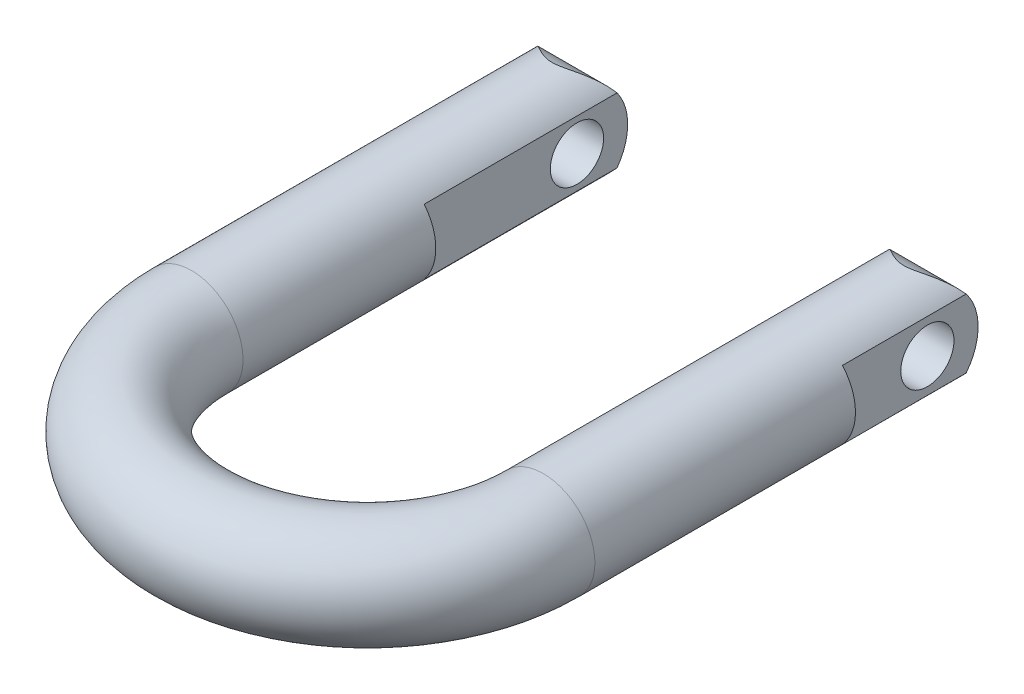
ISO-10303-21;
HEADER;
FILE_DESCRIPTION(('STEP AP214'),'2;1');
FILE_NAME('part.step','',(''),(''),'','','');
FILE_SCHEMA(('AUTOMOTIVE_DESIGN { 1 0 10303 214 1 1 1 1 }'));
ENDSEC;
DATA;
#1=APPLICATION_CONTEXT('core data for automotive mechanical design processes');
#2=APPLICATION_PROTOCOL_DEFINITION('international standard','automotive_design',2000,#1);
#3=PRODUCT_CONTEXT('',#1,'mechanical');
#4=PRODUCT('Part','Part','',(#3));
#5=PRODUCT_RELATED_PRODUCT_CATEGORY('part','',(#4));
#6=PRODUCT_DEFINITION_FORMATION('','',#4);
#7=PRODUCT_DEFINITION_CONTEXT('part definition',#1,'design');
#8=PRODUCT_DEFINITION('design','',#6,#7);
#9=PRODUCT_DEFINITION_SHAPE('','',#8);
#10=(LENGTH_UNIT() NAMED_UNIT(*) SI_UNIT(.MILLI.,.METRE.));
#11=(NAMED_UNIT(*) PLANE_ANGLE_UNIT() SI_UNIT($,.RADIAN.));
#12=(NAMED_UNIT(*) SI_UNIT($,.STERADIAN.) SOLID_ANGLE_UNIT());
#13=UNCERTAINTY_MEASURE_WITH_UNIT(LENGTH_MEASURE(1.E-05),#10,'distance_accuracy_value','');
#14=(GEOMETRIC_REPRESENTATION_CONTEXT(3) GLOBAL_UNCERTAINTY_ASSIGNED_CONTEXT((#13)) GLOBAL_UNIT_ASSIGNED_CONTEXT((#10,
#11,#12)) REPRESENTATION_CONTEXT('',''));
#15=CARTESIAN_POINT('',(0.,0.,0.));
#16=DIRECTION('',(0.,0.,1.));
#17=DIRECTION('',(1.,0.,0.));
#18=AXIS2_PLACEMENT_3D('',#15,#16,#17);
#19=CARTESIAN_POINT('',(32.95,0.,66.9));
#20=DIRECTION('',(0.,0.,-1.));
#21=DIRECTION('',(-1.,0.,0.));
#22=AXIS2_PLACEMENT_3D('',#19,#20,#21);
#23=CYLINDRICAL_SURFACE('',#22,9.65);
#24=CARTESIAN_POINT('',(23.3,0.,-9.5));
#25=CARTESIAN_POINT('',(23.2999989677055,-0.220681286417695,-9.50000102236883));
#26=CARTESIAN_POINT('',(23.3075827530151,-0.441350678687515,-9.49289476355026));
#27=CARTESIAN_POINT('',(23.3377534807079,-0.880739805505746,-9.46463613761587));
#28=CARTESIAN_POINT('',(23.360339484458,-1.09945966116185,-9.44348464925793));
#29=CARTESIAN_POINT('',(23.4200595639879,-1.53319289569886,-9.38759805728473));
#30=CARTESIAN_POINT('',(23.4571978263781,-1.7482051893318,-9.35285904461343));
#31=CARTESIAN_POINT('',(23.54530783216,-2.1728543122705,-9.27052574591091));
#32=CARTESIAN_POINT('',(23.5962800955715,-2.3824909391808,-9.22293097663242));
#33=CARTESIAN_POINT('',(23.7107883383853,-2.79369468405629,-9.11615386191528));
#34=CARTESIAN_POINT('',(23.7742405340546,-2.99530538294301,-9.05704881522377));
#35=CARTESIAN_POINT('',(23.9129610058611,-3.3909276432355,-8.92804826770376));
#36=CARTESIAN_POINT('',(23.9882336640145,-3.58493635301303,-8.85814876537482));
#37=CARTESIAN_POINT('',(24.1495519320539,-3.96448346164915,-8.70865223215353));
#38=CARTESIAN_POINT('',(24.2355955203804,-4.15002344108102,-8.62905702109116));
#39=CARTESIAN_POINT('',(24.4174878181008,-4.51218561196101,-8.46121141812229));
#40=CARTESIAN_POINT('',(24.513338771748,-4.68880574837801,-8.37295904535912));
#41=CARTESIAN_POINT('',(24.7545630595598,-5.1025073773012,-8.1515112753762));
#42=CARTESIAN_POINT('',(24.9042656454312,-5.33508985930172,-8.01459460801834));
#43=CARTESIAN_POINT('',(25.2188425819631,-5.78155019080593,-7.72842456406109));
#44=CARTESIAN_POINT('',(25.3837182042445,-5.99542646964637,-7.5791701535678));
#45=CARTESIAN_POINT('',(25.7272608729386,-6.4051727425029,-7.27030217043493));
#46=CARTESIAN_POINT('',(25.9059687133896,-6.60098542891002,-7.11065819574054));
#47=CARTESIAN_POINT('',(26.2751867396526,-6.97411325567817,-6.78375033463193));
#48=CARTESIAN_POINT('',(26.4656957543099,-7.15143022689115,-6.61648720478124));
#49=CARTESIAN_POINT('',(26.9101472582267,-7.53326707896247,-6.23078912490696));
#50=CARTESIAN_POINT('',(27.1673740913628,-7.73228447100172,-6.01068615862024));
#51=CARTESIAN_POINT('',(27.6981885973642,-8.10220931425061,-5.56614223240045));
#52=CARTESIAN_POINT('',(27.9717882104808,-8.27309590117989,-5.34169818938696));
#53=CARTESIAN_POINT('',(28.3942412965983,-8.50843161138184,-5.00648112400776));
#54=CARTESIAN_POINT('',(28.5369032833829,-8.58330646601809,-4.89510615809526));
#55=CARTESIAN_POINT('',(28.8266119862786,-8.72618308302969,-4.67367047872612));
#56=CARTESIAN_POINT('',(28.9736581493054,-8.79418570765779,-4.56360960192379));
#57=CARTESIAN_POINT('',(29.2723743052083,-8.92322891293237,-4.34606304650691));
#58=CARTESIAN_POINT('',(29.4240393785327,-8.98427659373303,-4.23857483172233));
#59=CARTESIAN_POINT('',(29.732690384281,-9.09937089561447,-4.02761458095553));
#60=CARTESIAN_POINT('',(29.8896747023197,-9.15341961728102,-3.92414134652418));
#61=CARTESIAN_POINT('',(30.1615623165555,-9.23909353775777,-3.75360588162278));
#62=CARTESIAN_POINT('',(30.2748929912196,-9.27256824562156,-3.6849666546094));
#63=CARTESIAN_POINT('',(30.5048983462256,-9.33585627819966,-3.55169203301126));
#64=CARTESIAN_POINT('',(30.6215730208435,-9.36566960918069,-3.48705663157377));
#65=CARTESIAN_POINT('',(30.8585439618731,-9.42141728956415,-3.36311294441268));
#66=CARTESIAN_POINT('',(30.9788374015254,-9.447354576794,-3.30380063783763));
#67=CARTESIAN_POINT('',(31.2233538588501,-9.49509010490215,-3.1921112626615));
#68=CARTESIAN_POINT('',(31.347576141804,-9.51688911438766,-3.13973290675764));
#69=CARTESIAN_POINT('',(31.674476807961,-9.56747485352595,-3.01577995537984));
#70=CARTESIAN_POINT('',(31.8804488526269,-9.5928640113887,-2.9509580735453));
#71=CARTESIAN_POINT('',(32.1955656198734,-9.62104220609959,-2.8778026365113));
#72=CARTESIAN_POINT('',(32.3015288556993,-9.62878138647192,-2.85743822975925));
#73=CARTESIAN_POINT('',(32.5149656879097,-9.64078051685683,-2.82569187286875));
#74=CARTESIAN_POINT('',(32.6224384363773,-9.64504234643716,-2.81430507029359));
#75=CARTESIAN_POINT('',(32.8389475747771,-9.64997303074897,-2.80112157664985));
#76=CARTESIAN_POINT('',(32.9479895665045,-9.65061225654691,-2.7994039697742));
#77=CARTESIAN_POINT('',(33.165713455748,-9.64820457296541,-2.80584890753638));
#78=CARTESIAN_POINT('',(33.2743953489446,-9.64515761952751,-2.81401157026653));
#79=CARTESIAN_POINT('',(33.5988578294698,-9.63058736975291,-2.85275774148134));
#80=CARTESIAN_POINT('',(33.8128016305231,-9.61362923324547,-2.89761337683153));
#81=CARTESIAN_POINT('',(34.1692123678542,-9.5738355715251,-2.99916062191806));
#82=CARTESIAN_POINT('',(34.3143058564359,-9.55416304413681,-3.04856943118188));
#83=CARTESIAN_POINT('',(34.5993391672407,-9.50909857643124,-3.15861036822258));
#84=CARTESIAN_POINT('',(34.7392758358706,-9.48370320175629,-3.21924923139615));
#85=CARTESIAN_POINT('',(35.0145373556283,-9.42761944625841,-3.34909672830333));
#86=CARTESIAN_POINT('',(35.1498449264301,-9.3969133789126,-3.41833377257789));
#87=CARTESIAN_POINT('',(35.4159144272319,-9.33062489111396,-3.56300122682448));
#88=CARTESIAN_POINT('',(35.5466745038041,-9.29504051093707,-3.63843412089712));
#89=CARTESIAN_POINT('',(35.8159695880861,-9.21575833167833,-3.80094575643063));
#90=CARTESIAN_POINT('',(35.9541105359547,-9.17161503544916,-3.88845709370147));
#91=CARTESIAN_POINT('',(36.2261115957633,-9.07800989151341,-4.06723179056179));
#92=CARTESIAN_POINT('',(36.359970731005,-9.02854684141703,-4.15849599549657));
#93=CARTESIAN_POINT('',(36.7560226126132,-8.87228409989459,-4.43617968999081));
#94=CARTESIAN_POINT('',(37.0125157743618,-8.75766276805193,-4.62638113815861));
#95=CARTESIAN_POINT('',(37.5128716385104,-8.50769827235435,-5.01049159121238));
#96=CARTESIAN_POINT('',(37.7567147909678,-8.37232424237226,-5.20440573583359));
#97=CARTESIAN_POINT('',(38.2321727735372,-8.08077114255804,-5.59138597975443));
#98=CARTESIAN_POINT('',(38.4637921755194,-7.92459992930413,-5.78445237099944));
#99=CARTESIAN_POINT('',(38.9368302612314,-7.57463985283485,-6.18515280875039));
#100=CARTESIAN_POINT('',(39.1769962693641,-7.37866660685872,-6.39236776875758));
#101=CARTESIAN_POINT('',(39.6414358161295,-6.96023545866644,-6.79803072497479));
#102=CARTESIAN_POINT('',(39.8657041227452,-6.73776890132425,-6.99647582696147));
#103=CARTESIAN_POINT('',(40.2953778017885,-6.26652051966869,-7.38002120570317));
#104=CARTESIAN_POINT('',(40.5008408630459,-6.01782458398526,-7.56516189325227));
#105=CARTESIAN_POINT('',(40.890537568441,-5.49335235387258,-7.91853810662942));
#106=CARTESIAN_POINT('',(41.074786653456,-5.21759602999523,-8.08678591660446));
#107=CARTESIAN_POINT('',(41.3533460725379,-4.74869255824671,-8.34231525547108));
#108=CARTESIAN_POINT('',(41.455353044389,-4.56365385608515,-8.43618650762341));
#109=CARTESIAN_POINT('',(41.6485633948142,-4.18364625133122,-8.61440975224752));
#110=CARTESIAN_POINT('',(41.7397700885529,-3.98868042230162,-8.69876466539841));
#111=CARTESIAN_POINT('',(41.9102171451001,-3.58944290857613,-8.85670574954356));
#112=CARTESIAN_POINT('',(41.989461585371,-3.38517442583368,-8.93029558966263));
#113=CARTESIAN_POINT('',(42.1348447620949,-2.96814424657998,-9.06550349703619));
#114=CARTESIAN_POINT('',(42.2009830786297,-2.75538227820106,-9.12712118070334));
#115=CARTESIAN_POINT('',(42.3195113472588,-2.32075708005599,-9.23766814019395));
#116=CARTESIAN_POINT('',(42.3717798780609,-2.09883194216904,-9.28648531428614));
#117=CARTESIAN_POINT('',(42.4607895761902,-1.64920939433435,-9.3696788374));
#118=CARTESIAN_POINT('',(42.4975307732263,-1.42151199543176,-9.40405521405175));
#119=CARTESIAN_POINT('',(42.5546703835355,-0.962432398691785,-9.45753830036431));
#120=CARTESIAN_POINT('',(42.5750787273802,-0.731052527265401,-9.47665428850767));
#121=CARTESIAN_POINT('',(42.5991150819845,-0.266671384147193,-9.49917004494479));
#122=CARTESIAN_POINT('',(42.6027450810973,-0.0336703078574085,-9.50257167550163));
#123=CARTESIAN_POINT('',(42.593741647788,0.403010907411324,-9.49413679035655));
#124=CARTESIAN_POINT('',(42.583054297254,0.606771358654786,-9.48412366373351));
#125=CARTESIAN_POINT('',(42.548916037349,1.01227683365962,-9.45215357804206));
#126=CARTESIAN_POINT('',(42.525465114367,1.2140218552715,-9.43019660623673));
#127=CARTESIAN_POINT('',(42.4662051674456,1.6140739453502,-9.37475068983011));
#128=CARTESIAN_POINT('',(42.4303958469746,1.81238093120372,-9.34126146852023));
#129=CARTESIAN_POINT('',(42.3470038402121,2.204306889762,-9.26334738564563));
#130=CARTESIAN_POINT('',(42.2994206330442,2.39792565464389,-9.21892204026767));
#131=CARTESIAN_POINT('',(42.1931791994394,2.77945123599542,-9.11985346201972));
#132=CARTESIAN_POINT('',(42.1345192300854,2.96735714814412,-9.06520862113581));
#133=CARTESIAN_POINT('',(42.0069153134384,3.33661507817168,-8.94652088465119));
#134=CARTESIAN_POINT('',(41.9379676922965,3.51796472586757,-8.88247463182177));
#135=CARTESIAN_POINT('',(41.7169180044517,4.05110320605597,-8.67751435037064));
#136=CARTESIAN_POINT('',(41.5505407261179,4.39222185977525,-8.5237148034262));
#137=CARTESIAN_POINT('',(41.2333327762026,4.95838564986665,-8.23207000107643));
#138=CARTESIAN_POINT('',(41.0895337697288,5.19069881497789,-8.10031714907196));
#139=CARTESIAN_POINT('',(40.7867339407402,5.63745292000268,-7.82426929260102));
#140=CARTESIAN_POINT('',(40.6277270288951,5.85188663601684,-7.67996926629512));
#141=CARTESIAN_POINT('',(40.2960087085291,6.26328424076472,-7.38084210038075));
#142=CARTESIAN_POINT('',(40.1232578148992,6.46019408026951,-7.22598482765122));
#143=CARTESIAN_POINT('',(39.7660175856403,6.8360525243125,-6.90836696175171));
#144=CARTESIAN_POINT('',(39.5815292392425,7.01500263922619,-6.74560703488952));
#145=CARTESIAN_POINT('',(39.1467202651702,7.40482865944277,-6.36606223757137));
#146=CARTESIAN_POINT('',(38.8928527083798,7.60986285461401,-6.14732663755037));
#147=CARTESIAN_POINT('',(38.3686774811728,7.99159963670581,-5.70460140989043));
#148=CARTESIAN_POINT('',(38.0983587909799,8.1682829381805,-5.48060832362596));
#149=CARTESIAN_POINT('',(37.5419996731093,8.49351219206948,-5.03320959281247));
#150=CARTESIAN_POINT('',(37.255997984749,8.6421237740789,-4.80980381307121));
#151=CARTESIAN_POINT('',(36.8134935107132,8.84432618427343,-4.48058242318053));
#152=CARTESIAN_POINT('',(36.663798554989,8.90825501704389,-4.37186162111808));
#153=CARTESIAN_POINT('',(36.3593287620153,9.02916556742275,-4.15774561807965));
#154=CARTESIAN_POINT('',(36.2045552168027,9.08614903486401,-4.05234958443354));
#155=CARTESIAN_POINT('',(35.9345658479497,9.17763131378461,-3.87631377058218));
#156=CARTESIAN_POINT('',(35.8207760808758,9.21388319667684,-3.80439629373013));
#157=CARTESIAN_POINT('',(35.5899219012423,9.28266263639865,-3.66410922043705));
#158=CARTESIAN_POINT('',(35.4728575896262,9.3151903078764,-3.59573951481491));
#159=CARTESIAN_POINT('',(35.2350740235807,9.37635306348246,-3.46371811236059));
#160=CARTESIAN_POINT('',(35.114354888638,9.4049882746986,-3.40006626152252));
#161=CARTESIAN_POINT('',(34.8689687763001,9.45810977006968,-3.27903587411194));
#162=CARTESIAN_POINT('',(34.7443022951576,9.48259657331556,-3.22165655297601));
#163=CARTESIAN_POINT('',(34.4098512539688,9.54125986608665,-3.0811408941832));
#164=CARTESIAN_POINT('',(34.1963229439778,9.57170462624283,-3.00480981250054));
#165=CARTESIAN_POINT('',(33.8685208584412,9.6068138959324,-2.9148594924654));
#166=CARTESIAN_POINT('',(33.7581351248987,9.61675187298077,-2.88898305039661));
#167=CARTESIAN_POINT('',(33.5353252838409,9.63287846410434,-2.84666497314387));
#168=CARTESIAN_POINT('',(33.4229024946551,9.63906941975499,-2.83021744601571));
#169=CARTESIAN_POINT('',(33.1954804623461,9.64755619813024,-2.80760490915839));
#170=CARTESIAN_POINT('',(33.0804665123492,9.6498037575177,-2.80156732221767));
#171=CARTESIAN_POINT('',(32.8503874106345,9.65017158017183,-2.80058180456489));
#172=CARTESIAN_POINT('',(32.7353222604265,9.64829195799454,-2.80563356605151));
#173=CARTESIAN_POINT('',(32.5061392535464,9.64046972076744,-2.82649425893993));
#174=CARTESIAN_POINT('',(32.392023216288,9.63452058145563,-2.84232046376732));
#175=CARTESIAN_POINT('',(32.1658242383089,9.61875515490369,-2.88375443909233));
#176=CARTESIAN_POINT('',(32.0537427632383,9.60893618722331,-2.90936898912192));
#177=CARTESIAN_POINT('',(31.6558544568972,9.56718157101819,-3.01651650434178));
#178=CARTESIAN_POINT('',(31.3775129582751,9.52492047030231,-3.12215668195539));
#179=CARTESIAN_POINT('',(30.9748234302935,9.44669826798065,-3.30541284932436));
#180=CARTESIAN_POINT('',(30.8427517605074,9.41806188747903,-3.37082624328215));
#181=CARTESIAN_POINT('',(30.582987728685,9.35614895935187,-3.50791229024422));
#182=CARTESIAN_POINT('',(30.455294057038,9.32287381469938,-3.57958304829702));
#183=CARTESIAN_POINT('',(30.1924380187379,9.24871275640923,-3.7342392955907));
#184=CARTESIAN_POINT('',(30.0576546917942,9.20740969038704,-3.81766078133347));
#185=CARTESIAN_POINT('',(29.7922310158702,9.11978641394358,-3.98839487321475));
#186=CARTESIAN_POINT('',(29.6615914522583,9.07346525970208,-4.07570820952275));
#187=CARTESIAN_POINT('',(29.2750098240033,8.92709666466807,-4.34177168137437));
#188=CARTESIAN_POINT('',(29.0245848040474,8.81969561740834,-4.52453515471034));
#189=CARTESIAN_POINT('',(28.5358458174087,8.58552148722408,-4.89446743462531));
#190=CARTESIAN_POINT('',(28.2975497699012,8.45872079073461,-5.08164219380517));
#191=CARTESIAN_POINT('',(27.8324966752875,8.18573797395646,-5.45598493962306));
#192=CARTESIAN_POINT('',(27.6057352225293,8.03956333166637,-5.64315290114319));
#193=CARTESIAN_POINT('',(27.1384783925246,7.70970241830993,-6.03545354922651));
#194=CARTESIAN_POINT('',(26.8993407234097,7.5236421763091,-6.24021713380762));
#195=CARTESIAN_POINT('',(26.4359724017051,7.12622620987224,-6.64223280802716));
#196=CARTESIAN_POINT('',(26.2117464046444,6.91486264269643,-6.83948254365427));
#197=CARTESIAN_POINT('',(25.7807730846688,6.46691551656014,-7.22219086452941));
#198=CARTESIAN_POINT('',(25.5739754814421,6.2304092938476,-7.40768295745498));
#199=CARTESIAN_POINT('',(25.1797785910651,5.73124754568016,-7.7636844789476));
#200=CARTESIAN_POINT('',(24.9923749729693,5.46859788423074,-7.93419725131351));
#201=CARTESIAN_POINT('',(24.7023648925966,5.01437595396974,-8.1993814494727));
#202=CARTESIAN_POINT('',(24.5931069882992,4.83027243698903,-8.29964329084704));
#203=CARTESIAN_POINT('',(24.3853198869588,4.45144954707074,-8.49083351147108));
#204=CARTESIAN_POINT('',(24.2867892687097,4.2567315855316,-8.58176312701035));
#205=CARTESIAN_POINT('',(24.1016672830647,3.85719755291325,-8.75297093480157));
#206=CARTESIAN_POINT('',(24.0150746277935,3.65238257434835,-8.83325027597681));
#207=CARTESIAN_POINT('',(23.8551071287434,3.23351999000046,-8.98180434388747));
#208=CARTESIAN_POINT('',(23.7817268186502,3.01947624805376,-9.0500840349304));
#209=CARTESIAN_POINT('',(23.6483498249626,2.57980438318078,-9.1743470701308));
#210=CARTESIAN_POINT('',(23.5885810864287,2.35404722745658,-9.23012077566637));
#211=CARTESIAN_POINT('',(23.4851231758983,1.895727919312,-9.32674929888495));
#212=CARTESIAN_POINT('',(23.4414338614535,1.66316582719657,-9.36760424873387));
#213=CARTESIAN_POINT('',(23.3711350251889,1.19340091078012,-9.43337676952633));
#214=CARTESIAN_POINT('',(23.344513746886,0.95620139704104,-9.45830531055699));
#215=CARTESIAN_POINT('',(23.308947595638,0.479329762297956,-9.4916156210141));
#216=CARTESIAN_POINT('',(23.3000011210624,0.239657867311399,-9.49999888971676));
#217=CARTESIAN_POINT('',(23.3,0.,-9.5));
#218=B_SPLINE_CURVE_WITH_KNOTS('',3,(#24,#25,#26,#27,#28,#29,#30,#31,#32,#33,#34,#35,#36,#37,
#38,#39,#40,#41,#42,#43,#44,#45,#46,#47,#48,#49,#50,#51,#52,#53,#54,#55,#56,#57,#58,#59,#60,#61,
#62,#63,#64,#65,#66,#67,#68,#69,#70,#71,#72,#73,#74,#75,#76,#77,#78,#79,#80,#81,#82,#83,#84,#85,
#86,#87,#88,#89,#90,#91,#92,#93,#94,#95,#96,#97,#98,#99,#100,#101,#102,#103,#104,#105,#106,#107,
#108,#109,#110,#111,#112,#113,#114,#115,#116,#117,#118,#119,#120,#121,#122,#123,#124,#125,#126,
#127,#128,#129,#130,#131,#132,#133,#134,#135,#136,#137,#138,#139,#140,#141,#142,#143,#144,#145,
#146,#147,#148,#149,#150,#151,#152,#153,#154,#155,#156,#157,#158,#159,#160,#161,#162,#163,#164,
#165,#166,#167,#168,#169,#170,#171,#172,#173,#174,#175,#176,#177,#178,#179,#180,#181,#182,#183,
#184,#185,#186,#187,#188,#189,#190,#191,#192,#193,#194,#195,#196,#197,#198,#199,#200,#201,#202,
#203,#204,#205,#206,#207,#208,#209,#210,#211,#212,#213,#214,#215,#216,#217),.UNSPECIFIED.,.T.,
.F.,(4,2,2,2,2,2,2,2,2,2,2,2,2,2,2,2,2,2,2,2,2,2,2,2,2,2,2,2,2,2,2,2,2,2,2,2,2,2,2,2,2,2,2,2,2,
2,2,2,2,2,2,2,2,2,2,2,2,2,2,2,2,2,2,2,2,2,2,2,2,2,2,2,2,2,2,2,2,2,2,2,2,2,2,2,2,2,2,2,2,2,2,2,2,
2,2,2,4),(0.,0.661781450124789,1.32352149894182,1.98545206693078,2.64740752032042,
3.30506196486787,3.96296078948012,4.62073631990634,5.27866270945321,6.20317462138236,
7.12776408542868,8.05519263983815,8.98252930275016,10.1591731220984,11.3366857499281,
11.9241422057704,12.5115248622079,13.0983023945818,13.6849034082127,14.094757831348,
14.5046115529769,14.9141530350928,15.3236183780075,15.9731777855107,16.2973507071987,
16.6213482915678,16.9479920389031,17.2746396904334,17.9286845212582,18.3917117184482,
18.8550175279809,19.3198971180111,19.7849640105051,20.2928912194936,20.8009334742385,
21.8176516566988,22.8358969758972,23.8537587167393,24.9710423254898,26.0886919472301,
27.202789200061,28.3160703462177,29.0091196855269,29.7019557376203,30.3945550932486,
31.0871766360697,31.7856752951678,32.4841726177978,33.1822449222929,33.8802344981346,
34.4923441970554,35.1044545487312,35.7165795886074,36.3287317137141,36.9409802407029,
37.553447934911,38.7776169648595,39.6865090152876,40.5957665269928,41.5077377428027,
42.4196321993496,43.5966155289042,44.7743961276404,45.9493881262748,46.5364575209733,
47.1233787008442,47.5414900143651,47.9595884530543,48.3776732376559,48.7957056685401,
49.4794031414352,49.8204564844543,50.1612964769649,50.5062796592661,50.851253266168,
51.1967812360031,51.5425489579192,52.4387215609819,52.8890712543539,53.3392850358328,
53.8305042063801,54.3218159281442,55.3050888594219,56.2897746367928,57.2740814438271,
58.3699846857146,59.4662284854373,60.55919290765,61.6519127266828,62.3605271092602,
63.0690474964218,63.7774913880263,64.4856414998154,65.204897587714,65.9241473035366,
66.6429010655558,67.3615896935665),.UNSPECIFIED.);
#219=CARTESIAN_POINT('',(25.465,-6.09075323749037,-7.50618594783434));
#220=VERTEX_POINT('',#219);
#221=CARTESIAN_POINT('',(40.165,-6.40829735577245,-7.26372897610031));
#222=VERTEX_POINT('',#221);
#223=EDGE_CURVE('E33',#220,#222,#218,.T.);
#224=ORIENTED_EDGE('',*,*,#223,.T.);
#225=DIRECTION('',(0.,0.,-1.));
#226=VECTOR('',#225,1.);
#227=CARTESIAN_POINT('',(40.165,-6.40829735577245,66.9));
#228=LINE('',#227,#226);
#229=CARTESIAN_POINT('',(40.165,-6.40829735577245,15.9));
#230=VERTEX_POINT('',#229);
#231=EDGE_CURVE('E53',#222,#230,#228,.F.);
#232=ORIENTED_EDGE('',*,*,#231,.T.);
#233=CARTESIAN_POINT('',(32.95,0.,15.9));
#234=DIRECTION('',(0.,0.,-1.));
#235=DIRECTION('',(-1.,0.,0.));
#236=AXIS2_PLACEMENT_3D('',#233,#234,#235);
#237=CIRCLE('',#236,9.65);
#238=CARTESIAN_POINT('',(40.165,6.40829735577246,15.9));
#239=VERTEX_POINT('',#238);
#240=EDGE_CURVE('E131',#230,#239,#237,.F.);
#241=ORIENTED_EDGE('',*,*,#240,.T.);
#242=DIRECTION('',(0.,0.,-1.));
#243=VECTOR('',#242,1.);
#244=CARTESIAN_POINT('',(40.165,6.40829735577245,66.9));
#245=LINE('',#244,#243);
#246=CARTESIAN_POINT('',(40.165,6.40829735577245,-7.26372897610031));
#247=VERTEX_POINT('',#246);
#248=EDGE_CURVE('E48',#239,#247,#245,.T.);
#249=ORIENTED_EDGE('',*,*,#248,.T.);
#250=CARTESIAN_POINT('',(25.465,6.09075323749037,-7.50618594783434));
#251=VERTEX_POINT('',#250);
#252=EDGE_CURVE('E139',#247,#251,#218,.T.);
#253=ORIENTED_EDGE('',*,*,#252,.T.);
#254=DIRECTION('',(0.,0.,-1.));
#255=VECTOR('',#254,1.);
#256=CARTESIAN_POINT('',(25.465,6.09075323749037,66.9));
#257=LINE('',#256,#255);
#258=CARTESIAN_POINT('',(25.465,6.09075323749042,28.6));
#259=VERTEX_POINT('',#258);
#260=EDGE_CURVE('E137',#251,#259,#257,.F.);
#261=ORIENTED_EDGE('',*,*,#260,.T.);
#262=CARTESIAN_POINT('',(32.95,0.,28.6));
#263=DIRECTION('',(0.,0.,-1.));
#264=DIRECTION('',(-1.,0.,0.));
#265=AXIS2_PLACEMENT_3D('',#262,#263,#264);
#266=CIRCLE('',#265,9.65);
#267=CARTESIAN_POINT('',(25.465,-6.09075323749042,28.6));
#268=VERTEX_POINT('',#267);
#269=EDGE_CURVE('E133',#259,#268,#266,.F.);
#270=ORIENTED_EDGE('',*,*,#269,.T.);
#271=DIRECTION('',(0.,0.,-1.));
#272=VECTOR('',#271,1.);
#273=CARTESIAN_POINT('',(25.465,-6.09075323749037,66.9));
#274=LINE('',#273,#272);
#275=EDGE_CURVE('E136',#268,#220,#274,.T.);
#276=ORIENTED_EDGE('',*,*,#275,.T.);
#277=EDGE_LOOP('',(#224,#232,#241,#249,#253,#261,#270,#276));
#278=FACE_BOUND('',#277,.T.);
#279=CARTESIAN_POINT('',(32.95,0.,64.7));
#280=DIRECTION('',(0.,0.,1.));
#281=DIRECTION('',(1.,0.,0.));
#282=AXIS2_PLACEMENT_3D('',#279,#280,#281);
#283=CIRCLE('',#282,9.65);
#284=CARTESIAN_POINT('',(42.6,0.,64.7));
#285=VERTEX_POINT('',#284);
#286=EDGE_CURVE('E19',#285,#285,#283,.F.);
#287=ORIENTED_EDGE('',*,*,#286,.T.);
#288=EDGE_LOOP('',(#287));
#289=FACE_BOUND('',#288,.T.);
#290=ADVANCED_FACE('F14',(#278,#289),#23,.T.);
#291=CARTESIAN_POINT('',(40.165,-10.,15.9));
#292=DIRECTION('',(1.,0.,0.));
#293=DIRECTION('',(0.,0.,-1.));
#294=AXIS2_PLACEMENT_3D('',#291,#292,#293);
#295=PLANE('',#294);
#296=DIRECTION('',(0.,1.,0.));
#297=VECTOR('',#296,1.);
#298=CARTESIAN_POINT('',(40.165,-10.,15.9));
#299=LINE('',#298,#297);
#300=EDGE_CURVE('E145',#230,#239,#299,.T.);
#301=ORIENTED_EDGE('',*,*,#300,.F.);
#302=ORIENTED_EDGE('',*,*,#231,.F.);
#303=CARTESIAN_POINT('',(40.165,0.,0.8));
#304=DIRECTION('',(1.,0.,0.));
#305=DIRECTION('',(0.,0.,-1.));
#306=AXIS2_PLACEMENT_3D('',#303,#304,#305);
#307=CIRCLE('',#306,10.3);
#308=EDGE_CURVE('E197',#222,#247,#307,.T.);
#309=ORIENTED_EDGE('',*,*,#308,.T.);
#310=ORIENTED_EDGE('',*,*,#248,.F.);
#311=EDGE_LOOP('',(#301,#302,#309,#310));
#312=FACE_BOUND('',#311,.T.);
#313=CARTESIAN_POINT('',(40.165,0.,0.));
#314=DIRECTION('',(-1.,0.,0.));
#315=DIRECTION('',(0.,0.,1.));
#316=AXIS2_PLACEMENT_3D('',#313,#314,#315);
#317=CIRCLE('',#316,4.99);
#318=CARTESIAN_POINT('',(40.165,0.,4.99));
#319=VERTEX_POINT('',#318);
#320=EDGE_CURVE('E9',#319,#319,#317,.F.);
#321=ORIENTED_EDGE('',*,*,#320,.F.);
#322=EDGE_LOOP('',(#321));
#323=FACE_BOUND('',#322,.T.);
#324=ADVANCED_FACE('F163',(#312,#323),#295,.T.);
#325=CARTESIAN_POINT('',(25.465,-10.,-9.5));
#326=DIRECTION('',(-1.,0.,0.));
#327=DIRECTION('',(0.,0.,1.));
#328=AXIS2_PLACEMENT_3D('',#325,#326,#327);
#329=PLANE('',#328);
#330=CARTESIAN_POINT('',(25.465,0.,0.));
#331=DIRECTION('',(-1.,0.,0.));
#332=DIRECTION('',(0.,0.,1.));
#333=AXIS2_PLACEMENT_3D('',#330,#331,#332);
#334=CIRCLE('',#333,4.99);
#335=CARTESIAN_POINT('',(25.465,0.,4.99));
#336=VERTEX_POINT('',#335);
#337=EDGE_CURVE('E25',#336,#336,#334,.T.);
#338=ORIENTED_EDGE('',*,*,#337,.F.);
#339=EDGE_LOOP('',(#338));
#340=FACE_BOUND('',#339,.T.);
#341=ORIENTED_EDGE('',*,*,#260,.F.);
#342=CARTESIAN_POINT('',(25.465,0.,0.8));
#343=DIRECTION('',(-1.,0.,0.));
#344=DIRECTION('',(0.,0.,1.));
#345=AXIS2_PLACEMENT_3D('',#342,#343,#344);
#346=CIRCLE('',#345,10.3);
#347=EDGE_CURVE('E146',#251,#220,#346,.T.);
#348=ORIENTED_EDGE('',*,*,#347,.T.);
#349=ORIENTED_EDGE('',*,*,#275,.F.);
#350=DIRECTION('',(0.,1.,0.));
#351=VECTOR('',#350,1.);
#352=CARTESIAN_POINT('',(25.465,-10.,28.6));
#353=LINE('',#352,#351);
#354=EDGE_CURVE('E142',#268,#259,#353,.T.);
#355=ORIENTED_EDGE('',*,*,#354,.T.);
#356=EDGE_LOOP('',(#341,#348,#349,#355));
#357=FACE_BOUND('',#356,.T.);
#358=ADVANCED_FACE('F170',(#340,#357),#329,.T.);
#359=CARTESIAN_POINT('',(25.465,-10.,28.6));
#360=DIRECTION('',(0.,0.,-1.));
#361=DIRECTION('',(-1.,0.,0.));
#362=AXIS2_PLACEMENT_3D('',#359,#360,#361);
#363=PLANE('',#362);
#364=ORIENTED_EDGE('',*,*,#354,.F.);
#365=ORIENTED_EDGE('',*,*,#269,.F.);
#366=EDGE_LOOP('',(#364,#365));
#367=FACE_BOUND('',#366,.T.);
#368=ADVANCED_FACE('F166',(#367),#363,.T.);
#369=CARTESIAN_POINT('',(50.,-10.,15.9));
#370=DIRECTION('',(0.,0.,-1.));
#371=DIRECTION('',(-1.,0.,0.));
#372=AXIS2_PLACEMENT_3D('',#369,#370,#371);
#373=PLANE('',#372);
#374=ORIENTED_EDGE('',*,*,#300,.T.);
#375=ORIENTED_EDGE('',*,*,#240,.F.);
#376=EDGE_LOOP('',(#374,#375));
#377=FACE_BOUND('',#376,.T.);
#378=ADVANCED_FACE('F169',(#377),#373,.T.);
#379=CARTESIAN_POINT('',(-42.6,0.,0.));
#380=DIRECTION('',(1.,0.,0.));
#381=DIRECTION('',(0.,0.,-1.));
#382=AXIS2_PLACEMENT_3D('',#379,#380,#381);
#383=CYLINDRICAL_SURFACE('',#382,4.99);
#384=ORIENTED_EDGE('',*,*,#337,.T.);
#385=EDGE_LOOP('',(#384));
#386=FACE_BOUND('',#385,.T.);
#387=ORIENTED_EDGE('',*,*,#320,.T.);
#388=EDGE_LOOP('',(#387));
#389=FACE_BOUND('',#388,.T.);
#390=ADVANCED_FACE('F177',(#386,#389),#383,.F.);
#391=CARTESIAN_POINT('',(-42.6,0.,0.8));
#392=DIRECTION('',(1.,0.,0.));
#393=DIRECTION('',(0.,0.,-1.));
#394=AXIS2_PLACEMENT_3D('',#391,#392,#393);
#395=CYLINDRICAL_SURFACE('',#394,10.3);
#396=ORIENTED_EDGE('',*,*,#347,.F.);
#397=ORIENTED_EDGE('',*,*,#252,.F.);
#398=ORIENTED_EDGE('',*,*,#308,.F.);
#399=ORIENTED_EDGE('',*,*,#223,.F.);
#400=EDGE_LOOP('',(#396,#397,#398,#399));
#401=FACE_BOUND('',#400,.T.);
#402=ADVANCED_FACE('F16',(#401),#395,.T.);
#403=CARTESIAN_POINT('',(0.,0.,64.7));
#404=DIRECTION('',(0.,1.,0.));
#405=DIRECTION('',(0.,0.,1.));
#406=AXIS2_PLACEMENT_3D('',#403,#404,#405);
#407=TOROIDAL_SURFACE('',#406,32.95,9.65);
#408=CARTESIAN_POINT('',(-32.95,0.,64.7));
#409=DIRECTION('',(0.,0.,1.));
#410=DIRECTION('',(1.,0.,0.));
#411=AXIS2_PLACEMENT_3D('',#408,#409,#410);
#412=CIRCLE('',#411,9.65);
#413=CARTESIAN_POINT('',(-42.6,0.,64.7));
#414=VERTEX_POINT('',#413);
#415=EDGE_CURVE('E106',#414,#414,#412,.T.);
#416=CARTESIAN_POINT('',(0.,0.,64.7));
#417=DIRECTION('',(0.,1.,0.));
#418=DIRECTION('',(0.,0.,1.));
#419=AXIS2_PLACEMENT_3D('',#416,#417,#418);
#420=CIRCLE('',#419,42.6);
#421=EDGE_CURVE('',#414,#285,#420,.T.);
#422=ORIENTED_EDGE('',*,*,#415,.T.);
#423=ORIENTED_EDGE('',*,*,#286,.F.);
#424=ORIENTED_EDGE('',*,*,#421,.T.);
#425=ORIENTED_EDGE('',*,*,#421,.F.);
#426=EDGE_LOOP('',(#422,#424,#423,#425));
#427=FACE_BOUND('',#426,.T.);
#428=ADVANCED_FACE('F164',(#427),#407,.T.);
#429=CARTESIAN_POINT('',(-42.6,0.,0.));
#430=DIRECTION('',(1.,0.,0.));
#431=DIRECTION('',(0.,0.,-1.));
#432=AXIS2_PLACEMENT_3D('',#429,#430,#431);
#433=CYLINDRICAL_SURFACE('',#432,4.99);
#434=CARTESIAN_POINT('',(-40.165,0.,0.));
#435=DIRECTION('',(1.,0.,0.));
#436=DIRECTION('',(0.,0.,-1.));
#437=AXIS2_PLACEMENT_3D('',#434,#435,#436);
#438=CIRCLE('',#437,4.99);
#439=CARTESIAN_POINT('',(-40.165,0.,-4.99));
#440=VERTEX_POINT('',#439);
#441=EDGE_CURVE('E219',#440,#440,#438,.F.);
#442=ORIENTED_EDGE('',*,*,#441,.T.);
#443=EDGE_LOOP('',(#442));
#444=FACE_BOUND('',#443,.T.);
#445=CARTESIAN_POINT('',(-25.465,0.,0.));
#446=DIRECTION('',(-1.,0.,0.));
#447=DIRECTION('',(0.,0.,1.));
#448=AXIS2_PLACEMENT_3D('',#445,#446,#447);
#449=CIRCLE('',#448,4.99);
#450=CARTESIAN_POINT('',(-25.465,0.,4.99));
#451=VERTEX_POINT('',#450);
#452=EDGE_CURVE('E96',#451,#451,#449,.T.);
#453=ORIENTED_EDGE('',*,*,#452,.F.);
#454=EDGE_LOOP('',(#453));
#455=FACE_BOUND('',#454,.T.);
#456=ADVANCED_FACE('F203',(#444,#455),#433,.F.);
#457=CARTESIAN_POINT('',(-25.465,-10.,28.6));
#458=DIRECTION('',(0.,0.,1.));
#459=DIRECTION('',(1.,0.,0.));
#460=AXIS2_PLACEMENT_3D('',#457,#458,#459);
#461=PLANE('',#460);
#462=DIRECTION('',(0.,1.,0.));
#463=VECTOR('',#462,1.);
#464=CARTESIAN_POINT('',(-25.465,-10.,28.6));
#465=LINE('',#464,#463);
#466=CARTESIAN_POINT('',(-25.465,-6.09075323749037,28.6));
#467=VERTEX_POINT('',#466);
#468=CARTESIAN_POINT('',(-25.465,6.09075323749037,28.6));
#469=VERTEX_POINT('',#468);
#470=EDGE_CURVE('E116',#467,#469,#465,.T.);
#471=ORIENTED_EDGE('',*,*,#470,.T.);
#472=CARTESIAN_POINT('',(-32.95,0.,28.6));
#473=DIRECTION('',(0.,0.,1.));
#474=DIRECTION('',(1.,0.,0.));
#475=AXIS2_PLACEMENT_3D('',#472,#473,#474);
#476=CIRCLE('',#475,9.65);
#477=EDGE_CURVE('E126',#467,#469,#476,.T.);
#478=ORIENTED_EDGE('',*,*,#477,.F.);
#479=EDGE_LOOP('',(#471,#478));
#480=FACE_BOUND('',#479,.T.);
#481=ADVANCED_FACE('F224',(#480),#461,.F.);
#482=CARTESIAN_POINT('',(-25.465,-10.,-9.5));
#483=DIRECTION('',(-1.,0.,0.));
#484=DIRECTION('',(0.,0.,1.));
#485=AXIS2_PLACEMENT_3D('',#482,#483,#484);
#486=PLANE('',#485);
#487=ORIENTED_EDGE('',*,*,#452,.T.);
#488=EDGE_LOOP('',(#487));
#489=FACE_BOUND('',#488,.T.);
#490=CARTESIAN_POINT('',(-25.465,0.,0.8));
#491=DIRECTION('',(-1.,0.,0.));
#492=DIRECTION('',(0.,0.,1.));
#493=AXIS2_PLACEMENT_3D('',#490,#491,#492);
#494=CIRCLE('',#493,10.3);
#495=CARTESIAN_POINT('',(-25.465,6.09075323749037,-7.50618594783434));
#496=VERTEX_POINT('',#495);
#497=CARTESIAN_POINT('',(-25.465,-6.09075323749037,-7.50618594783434));
#498=VERTEX_POINT('',#497);
#499=EDGE_CURVE('E97',#496,#498,#494,.T.);
#500=ORIENTED_EDGE('',*,*,#499,.F.);
#501=DIRECTION('',(0.,0.,-1.));
#502=VECTOR('',#501,1.);
#503=CARTESIAN_POINT('',(-25.465,6.09075323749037,66.9));
#504=LINE('',#503,#502);
#505=EDGE_CURVE('E93',#469,#496,#504,.T.);
#506=ORIENTED_EDGE('',*,*,#505,.F.);
#507=ORIENTED_EDGE('',*,*,#470,.F.);
#508=DIRECTION('',(0.,0.,-1.));
#509=VECTOR('',#508,1.);
#510=CARTESIAN_POINT('',(-25.465,-6.09075323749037,66.9));
#511=LINE('',#510,#509);
#512=EDGE_CURVE('E123',#498,#467,#511,.F.);
#513=ORIENTED_EDGE('',*,*,#512,.F.);
#514=EDGE_LOOP('',(#500,#506,#507,#513));
#515=FACE_BOUND('',#514,.T.);
#516=ADVANCED_FACE('F212',(#489,#515),#486,.F.);
#517=CARTESIAN_POINT('',(-50.,-10.,15.9));
#518=DIRECTION('',(0.,0.,1.));
#519=DIRECTION('',(1.,0.,0.));
#520=AXIS2_PLACEMENT_3D('',#517,#518,#519);
#521=PLANE('',#520);
#522=DIRECTION('',(0.,1.,0.));
#523=VECTOR('',#522,1.);
#524=CARTESIAN_POINT('',(-40.165,-10.,15.9));
#525=LINE('',#524,#523);
#526=CARTESIAN_POINT('',(-40.165,-6.40829735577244,15.9));
#527=VERTEX_POINT('',#526);
#528=CARTESIAN_POINT('',(-40.165,6.40829735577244,15.9));
#529=VERTEX_POINT('',#528);
#530=EDGE_CURVE('E113',#527,#529,#525,.T.);
#531=ORIENTED_EDGE('',*,*,#530,.F.);
#532=CARTESIAN_POINT('',(-32.95,0.,15.9));
#533=DIRECTION('',(0.,0.,1.));
#534=DIRECTION('',(1.,0.,0.));
#535=AXIS2_PLACEMENT_3D('',#532,#533,#534);
#536=CIRCLE('',#535,9.65);
#537=EDGE_CURVE('E107',#529,#527,#536,.T.);
#538=ORIENTED_EDGE('',*,*,#537,.F.);
#539=EDGE_LOOP('',(#531,#538));
#540=FACE_BOUND('',#539,.T.);
#541=ADVANCED_FACE('F226',(#540),#521,.F.);
#542=CARTESIAN_POINT('',(-40.165,-10.,15.9));
#543=DIRECTION('',(1.,0.,0.));
#544=DIRECTION('',(0.,0.,-1.));
#545=AXIS2_PLACEMENT_3D('',#542,#543,#544);
#546=PLANE('',#545);
#547=ORIENTED_EDGE('',*,*,#530,.T.);
#548=DIRECTION('',(0.,0.,-1.));
#549=VECTOR('',#548,1.);
#550=CARTESIAN_POINT('',(-40.165,6.40829735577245,66.9));
#551=LINE('',#550,#549);
#552=CARTESIAN_POINT('',(-40.165,6.40829735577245,-7.26372897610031));
#553=VERTEX_POINT('',#552);
#554=EDGE_CURVE('E90',#553,#529,#551,.F.);
#555=ORIENTED_EDGE('',*,*,#554,.F.);
#556=CARTESIAN_POINT('',(-40.165,0.,0.8));
#557=DIRECTION('',(1.,0.,0.));
#558=DIRECTION('',(0.,0.,-1.));
#559=AXIS2_PLACEMENT_3D('',#556,#557,#558);
#560=CIRCLE('',#559,10.3);
#561=CARTESIAN_POINT('',(-40.165,-6.40829735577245,-7.26372897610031));
#562=VERTEX_POINT('',#561);
#563=EDGE_CURVE('E102',#562,#553,#560,.T.);
#564=ORIENTED_EDGE('',*,*,#563,.F.);
#565=DIRECTION('',(0.,0.,-1.));
#566=VECTOR('',#565,1.);
#567=CARTESIAN_POINT('',(-40.165,-6.40829735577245,66.9));
#568=LINE('',#567,#566);
#569=EDGE_CURVE('E114',#527,#562,#568,.T.);
#570=ORIENTED_EDGE('',*,*,#569,.F.);
#571=EDGE_LOOP('',(#547,#555,#564,#570));
#572=FACE_BOUND('',#571,.T.);
#573=ORIENTED_EDGE('',*,*,#441,.F.);
#574=EDGE_LOOP('',(#573));
#575=FACE_BOUND('',#574,.T.);
#576=ADVANCED_FACE('F110',(#572,#575),#546,.F.);
#577=CARTESIAN_POINT('',(-42.6,0.,0.8));
#578=DIRECTION('',(1.,0.,0.));
#579=DIRECTION('',(0.,0.,-1.));
#580=AXIS2_PLACEMENT_3D('',#577,#578,#579);
#581=CYLINDRICAL_SURFACE('',#580,10.3);
#582=ORIENTED_EDGE('',*,*,#563,.T.);
#583=CARTESIAN_POINT('',(-42.6,0.,-9.5));
#584=CARTESIAN_POINT('',(-42.6000010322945,0.220681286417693,-9.50000102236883));
#585=CARTESIAN_POINT('',(-42.5924172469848,0.44135067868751,-9.49289476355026));
#586=CARTESIAN_POINT('',(-42.562246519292,0.88073980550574,-9.46463613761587));
#587=CARTESIAN_POINT('',(-42.5396605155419,1.09945966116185,-9.44348464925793));
#588=CARTESIAN_POINT('',(-42.479940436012,1.53319289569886,-9.38759805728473));
#589=CARTESIAN_POINT('',(-42.4428021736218,1.7482051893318,-9.35285904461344));
#590=CARTESIAN_POINT('',(-42.35469216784,2.1728543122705,-9.27052574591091));
#591=CARTESIAN_POINT('',(-42.3037199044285,2.3824909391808,-9.22293097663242));
#592=CARTESIAN_POINT('',(-42.1892116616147,2.79369468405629,-9.11615386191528));
#593=CARTESIAN_POINT('',(-42.1257594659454,2.995305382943,-9.05704881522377));
#594=CARTESIAN_POINT('',(-41.9870389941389,3.39092764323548,-8.92804826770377));
#595=CARTESIAN_POINT('',(-41.9117663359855,3.58493635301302,-8.85814876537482));
#596=CARTESIAN_POINT('',(-41.7504480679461,3.96448346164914,-8.70865223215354));
#597=CARTESIAN_POINT('',(-41.6644044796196,4.15002344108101,-8.62905702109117));
#598=CARTESIAN_POINT('',(-41.4825121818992,4.512185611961,-8.46121141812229));
#599=CARTESIAN_POINT('',(-41.386661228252,4.68880574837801,-8.37295904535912));
#600=CARTESIAN_POINT('',(-41.1454369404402,5.1025073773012,-8.1515112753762));
#601=CARTESIAN_POINT('',(-40.9957343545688,5.3350898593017,-8.01459460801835));
#602=CARTESIAN_POINT('',(-40.6811574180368,5.78155019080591,-7.7284245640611));
#603=CARTESIAN_POINT('',(-40.5162817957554,5.99542646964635,-7.57917015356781));
#604=CARTESIAN_POINT('',(-40.1727391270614,6.40517274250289,-7.27030217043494));
#605=CARTESIAN_POINT('',(-39.9940312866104,6.60098542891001,-7.11065819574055));
#606=CARTESIAN_POINT('',(-39.6248132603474,6.97411325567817,-6.78375033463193));
#607=CARTESIAN_POINT('',(-39.4343042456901,7.15143022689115,-6.61648720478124));
#608=CARTESIAN_POINT('',(-38.9898527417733,7.53326707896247,-6.23078912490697));
#609=CARTESIAN_POINT('',(-38.7326259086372,7.73228447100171,-6.01068615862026));
#610=CARTESIAN_POINT('',(-38.2018114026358,8.10220931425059,-5.56614223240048));
#611=CARTESIAN_POINT('',(-37.9282117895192,8.27309590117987,-5.34169818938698));
#612=CARTESIAN_POINT('',(-37.5057587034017,8.50843161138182,-5.00648112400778));
#613=CARTESIAN_POINT('',(-37.3630967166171,8.58330646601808,-4.89510615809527));
#614=CARTESIAN_POINT('',(-37.0733880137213,8.72618308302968,-4.67367047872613));
#615=CARTESIAN_POINT('',(-36.9263418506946,8.79418570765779,-4.5636096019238));
#616=CARTESIAN_POINT('',(-36.6276256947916,8.92322891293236,-4.34606304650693));
#617=CARTESIAN_POINT('',(-36.4759606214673,8.98427659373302,-4.23857483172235));
#618=CARTESIAN_POINT('',(-36.167309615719,9.09937089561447,-4.02761458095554));
#619=CARTESIAN_POINT('',(-36.0103252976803,9.15341961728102,-3.92414134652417));
#620=CARTESIAN_POINT('',(-35.7384376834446,9.23909353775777,-3.75360588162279));
#621=CARTESIAN_POINT('',(-35.6251070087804,9.27256824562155,-3.68496665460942));
#622=CARTESIAN_POINT('',(-35.3951016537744,9.33585627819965,-3.5516920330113));
#623=CARTESIAN_POINT('',(-35.2784269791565,9.36566960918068,-3.48705663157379));
#624=CARTESIAN_POINT('',(-35.0414560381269,9.42141728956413,-3.36311294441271));
#625=CARTESIAN_POINT('',(-34.9211625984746,9.44735457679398,-3.30380063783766));
#626=CARTESIAN_POINT('',(-34.67664614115,9.49509010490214,-3.19211126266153));
#627=CARTESIAN_POINT('',(-34.5524238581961,9.51688911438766,-3.13973290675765));
#628=CARTESIAN_POINT('',(-34.225523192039,9.56747485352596,-3.01577995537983));
#629=CARTESIAN_POINT('',(-34.0195511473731,9.59286401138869,-2.95095807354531));
#630=CARTESIAN_POINT('',(-33.7044343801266,9.62104220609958,-2.87780263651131));
#631=CARTESIAN_POINT('',(-33.5984711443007,9.62878138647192,-2.85743822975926));
#632=CARTESIAN_POINT('',(-33.3850343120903,9.64078051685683,-2.82569187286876));
#633=CARTESIAN_POINT('',(-33.2775615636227,9.64504234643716,-2.81430507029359));
#634=CARTESIAN_POINT('',(-33.0610524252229,9.64997303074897,-2.80112157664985));
#635=CARTESIAN_POINT('',(-32.9520104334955,9.65061225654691,-2.79940396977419));
#636=CARTESIAN_POINT('',(-32.734286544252,9.64820457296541,-2.80584890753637));
#637=CARTESIAN_POINT('',(-32.6256046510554,9.64515761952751,-2.81401157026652));
#638=CARTESIAN_POINT('',(-32.3011421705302,9.63058736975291,-2.85275774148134));
#639=CARTESIAN_POINT('',(-32.0871983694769,9.61362923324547,-2.89761337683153));
#640=CARTESIAN_POINT('',(-31.7307876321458,9.5738355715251,-2.99916062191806));
#641=CARTESIAN_POINT('',(-31.5856941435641,9.55416304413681,-3.04856943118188));
#642=CARTESIAN_POINT('',(-31.3006608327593,9.50909857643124,-3.15861036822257));
#643=CARTESIAN_POINT('',(-31.1607241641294,9.4837032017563,-3.21924923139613));
#644=CARTESIAN_POINT('',(-30.8854626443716,9.42761944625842,-3.34909672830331));
#645=CARTESIAN_POINT('',(-30.7501550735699,9.39691337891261,-3.41833377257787));
#646=CARTESIAN_POINT('',(-30.4840855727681,9.33062489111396,-3.56300122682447));
#647=CARTESIAN_POINT('',(-30.3533254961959,9.29504051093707,-3.63843412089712));
#648=CARTESIAN_POINT('',(-30.0840304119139,9.21575833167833,-3.80094575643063));
#649=CARTESIAN_POINT('',(-29.9458894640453,9.17161503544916,-3.88845709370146));
#650=CARTESIAN_POINT('',(-29.6738884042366,9.07800989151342,-4.06723179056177));
#651=CARTESIAN_POINT('',(-29.540029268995,9.02854684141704,-4.15849599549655));
#652=CARTESIAN_POINT('',(-29.1439773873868,8.8722840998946,-4.43617968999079));
#653=CARTESIAN_POINT('',(-28.8874842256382,8.75766276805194,-4.62638113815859));
#654=CARTESIAN_POINT('',(-28.3871283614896,8.50769827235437,-5.01049159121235));
#655=CARTESIAN_POINT('',(-28.1432852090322,8.37232424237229,-5.20440573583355));
#656=CARTESIAN_POINT('',(-27.6678272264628,8.08077114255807,-5.59138597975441));
#657=CARTESIAN_POINT('',(-27.4362078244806,7.92459992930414,-5.78445237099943));
#658=CARTESIAN_POINT('',(-26.9631697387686,7.57463985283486,-6.18515280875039));
#659=CARTESIAN_POINT('',(-26.7230037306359,7.37866660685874,-6.39236776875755));
#660=CARTESIAN_POINT('',(-26.2585641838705,6.96023545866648,-6.79803072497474));
#661=CARTESIAN_POINT('',(-26.0342958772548,6.73776890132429,-6.99647582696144));
#662=CARTESIAN_POINT('',(-25.6046221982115,6.26652051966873,-7.38002120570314));
#663=CARTESIAN_POINT('',(-25.3991591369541,6.01782458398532,-7.56516189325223));
#664=CARTESIAN_POINT('',(-25.009462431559,5.49335235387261,-7.9185381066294));
#665=CARTESIAN_POINT('',(-24.8252133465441,5.21759602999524,-8.08678591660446));
#666=CARTESIAN_POINT('',(-24.5466539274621,4.74869255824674,-8.34231525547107));
#667=CARTESIAN_POINT('',(-24.444646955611,4.56365385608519,-8.43618650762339));
#668=CARTESIAN_POINT('',(-24.2514366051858,4.18364625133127,-8.61440975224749));
#669=CARTESIAN_POINT('',(-24.1602299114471,3.98868042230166,-8.69876466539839));
#670=CARTESIAN_POINT('',(-23.9897828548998,3.58944290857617,-8.85670574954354));
#671=CARTESIAN_POINT('',(-23.9105384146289,3.38517442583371,-8.93029558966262));
#672=CARTESIAN_POINT('',(-23.765155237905,2.96814424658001,-9.06550349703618));
#673=CARTESIAN_POINT('',(-23.6990169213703,2.75538227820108,-9.12712118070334));
#674=CARTESIAN_POINT('',(-23.5804886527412,2.32075708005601,-9.23766814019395));
#675=CARTESIAN_POINT('',(-23.5282201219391,2.09883194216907,-9.28648531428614));
#676=CARTESIAN_POINT('',(-23.4392104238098,1.64920939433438,-9.3696788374));
#677=CARTESIAN_POINT('',(-23.4024692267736,1.42151199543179,-9.40405521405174));
#678=CARTESIAN_POINT('',(-23.3453296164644,0.96243239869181,-9.45753830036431));
#679=CARTESIAN_POINT('',(-23.3249212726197,0.731052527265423,-9.47665428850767));
#680=CARTESIAN_POINT('',(-23.3008849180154,0.266671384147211,-9.49917004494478));
#681=CARTESIAN_POINT('',(-23.2972549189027,0.033670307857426,-9.50257167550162));
#682=CARTESIAN_POINT('',(-23.306258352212,-0.40301090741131,-9.49413679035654));
#683=CARTESIAN_POINT('',(-23.316945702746,-0.606771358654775,-9.48412366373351));
#684=CARTESIAN_POINT('',(-23.3510839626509,-1.01227683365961,-9.45215357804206));
#685=CARTESIAN_POINT('',(-23.3745348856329,-1.21402185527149,-9.43019660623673));
#686=CARTESIAN_POINT('',(-23.4337948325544,-1.61407394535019,-9.37475068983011));
#687=CARTESIAN_POINT('',(-23.4696041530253,-1.81238093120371,-9.34126146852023));
#688=CARTESIAN_POINT('',(-23.5529961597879,-2.20430688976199,-9.26334738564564));
#689=CARTESIAN_POINT('',(-23.6005793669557,-2.39792565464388,-9.21892204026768));
#690=CARTESIAN_POINT('',(-23.7068208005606,-2.77945123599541,-9.11985346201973));
#691=CARTESIAN_POINT('',(-23.7654807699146,-2.96735714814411,-9.06520862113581));
#692=CARTESIAN_POINT('',(-23.8930846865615,-3.33661507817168,-8.94652088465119));
#693=CARTESIAN_POINT('',(-23.9620323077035,-3.51796472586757,-8.88247463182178));
#694=CARTESIAN_POINT('',(-24.1830819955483,-4.05110320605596,-8.67751435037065));
#695=CARTESIAN_POINT('',(-24.3494592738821,-4.39222185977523,-8.5237148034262));
#696=CARTESIAN_POINT('',(-24.6666672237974,-4.95838564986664,-8.23207000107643));
#697=CARTESIAN_POINT('',(-24.8104662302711,-5.19069881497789,-8.10031714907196));
#698=CARTESIAN_POINT('',(-25.1132660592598,-5.63745292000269,-7.82426929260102));
#699=CARTESIAN_POINT('',(-25.2722729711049,-5.85188663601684,-7.67996926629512));
#700=CARTESIAN_POINT('',(-25.6039912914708,-6.26328424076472,-7.38084210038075));
#701=CARTESIAN_POINT('',(-25.7767421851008,-6.46019408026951,-7.22598482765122));
#702=CARTESIAN_POINT('',(-26.1339824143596,-6.8360525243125,-6.90836696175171));
#703=CARTESIAN_POINT('',(-26.3184707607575,-7.01500263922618,-6.74560703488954));
#704=CARTESIAN_POINT('',(-26.7532797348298,-7.40482865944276,-6.36606223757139));
#705=CARTESIAN_POINT('',(-27.0071472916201,-7.60986285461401,-6.14732663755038));
#706=CARTESIAN_POINT('',(-27.5313225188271,-7.99159963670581,-5.70460140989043));
#707=CARTESIAN_POINT('',(-27.80164120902,-8.1682829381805,-5.48060832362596));
#708=CARTESIAN_POINT('',(-28.3580003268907,-8.49351219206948,-5.03320959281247));
#709=CARTESIAN_POINT('',(-28.6440020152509,-8.6421237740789,-4.80980381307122));
#710=CARTESIAN_POINT('',(-29.0865064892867,-8.84432618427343,-4.48058242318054));
#711=CARTESIAN_POINT('',(-29.236201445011,-8.90825501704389,-4.37186162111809));
#712=CARTESIAN_POINT('',(-29.5406712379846,-9.02916556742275,-4.15774561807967));
#713=CARTESIAN_POINT('',(-29.6954447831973,-9.086149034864,-4.05234958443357));
#714=CARTESIAN_POINT('',(-29.9654341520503,-9.17763131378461,-3.87631377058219));
#715=CARTESIAN_POINT('',(-30.0792239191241,-9.21388319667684,-3.80439629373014));
#716=CARTESIAN_POINT('',(-30.3100780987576,-9.28266263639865,-3.66410922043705));
#717=CARTESIAN_POINT('',(-30.4271424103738,-9.3151903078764,-3.59573951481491));
#718=CARTESIAN_POINT('',(-30.6649259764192,-9.37635306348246,-3.46371811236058));
#719=CARTESIAN_POINT('',(-30.785645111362,-9.4049882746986,-3.4000662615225));
#720=CARTESIAN_POINT('',(-31.0310312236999,-9.45810977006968,-3.27903587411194));
#721=CARTESIAN_POINT('',(-31.1556977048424,-9.48259657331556,-3.22165655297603));
#722=CARTESIAN_POINT('',(-31.4901487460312,-9.54125986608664,-3.08114089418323));
#723=CARTESIAN_POINT('',(-31.7036770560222,-9.57170462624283,-3.00480981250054));
#724=CARTESIAN_POINT('',(-32.0314791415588,-9.60681389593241,-2.91485949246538));
#725=CARTESIAN_POINT('',(-32.1418648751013,-9.61675187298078,-2.8889830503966));
#726=CARTESIAN_POINT('',(-32.3646747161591,-9.63287846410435,-2.84666497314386));
#727=CARTESIAN_POINT('',(-32.4770975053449,-9.63906941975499,-2.83021744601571));
#728=CARTESIAN_POINT('',(-32.7045195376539,-9.64755619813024,-2.80760490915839));
#729=CARTESIAN_POINT('',(-32.8195334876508,-9.6498037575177,-2.80156732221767));
#730=CARTESIAN_POINT('',(-33.0496125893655,-9.65017158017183,-2.8005818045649));
#731=CARTESIAN_POINT('',(-33.1646777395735,-9.64829195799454,-2.80563356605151));
#732=CARTESIAN_POINT('',(-33.3938607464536,-9.64046972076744,-2.82649425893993));
#733=CARTESIAN_POINT('',(-33.507976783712,-9.63452058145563,-2.84232046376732));
#734=CARTESIAN_POINT('',(-33.7341757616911,-9.61875515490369,-2.88375443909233));
#735=CARTESIAN_POINT('',(-33.8462572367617,-9.60893618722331,-2.90936898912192));
#736=CARTESIAN_POINT('',(-34.2441455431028,-9.5671815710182,-3.01651650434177));
#737=CARTESIAN_POINT('',(-34.5224870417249,-9.52492047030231,-3.1221566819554));
#738=CARTESIAN_POINT('',(-34.9251765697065,-9.44669826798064,-3.30541284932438));
#739=CARTESIAN_POINT('',(-35.0572482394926,-9.41806188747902,-3.37082624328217));
#740=CARTESIAN_POINT('',(-35.317012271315,-9.35614895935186,-3.50791229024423));
#741=CARTESIAN_POINT('',(-35.444705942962,-9.32287381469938,-3.57958304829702));
#742=CARTESIAN_POINT('',(-35.7075619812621,-9.24871275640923,-3.7342392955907));
#743=CARTESIAN_POINT('',(-35.8423453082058,-9.20740969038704,-3.81766078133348));
#744=CARTESIAN_POINT('',(-36.1077689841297,-9.11978641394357,-3.98839487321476));
#745=CARTESIAN_POINT('',(-36.2384085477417,-9.07346525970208,-4.07570820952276));
#746=CARTESIAN_POINT('',(-36.6249901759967,-8.92709666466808,-4.34177168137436));
#747=CARTESIAN_POINT('',(-36.8754151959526,-8.81969561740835,-4.52453515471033));
#748=CARTESIAN_POINT('',(-37.3641541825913,-8.58552148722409,-4.89446743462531));
#749=CARTESIAN_POINT('',(-37.6024502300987,-8.45872079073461,-5.08164219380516));
#750=CARTESIAN_POINT('',(-38.0675033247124,-8.18573797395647,-5.45598493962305));
#751=CARTESIAN_POINT('',(-38.2942647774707,-8.03956333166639,-5.64315290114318));
#752=CARTESIAN_POINT('',(-38.7615216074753,-7.70970241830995,-6.03545354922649));
#753=CARTESIAN_POINT('',(-39.0006592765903,-7.52364217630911,-6.24021713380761));
#754=CARTESIAN_POINT('',(-39.4640275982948,-7.12622620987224,-6.64223280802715));
#755=CARTESIAN_POINT('',(-39.6882535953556,-6.91486264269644,-6.83948254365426));
#756=CARTESIAN_POINT('',(-40.1192269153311,-6.46691551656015,-7.2221908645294));
#757=CARTESIAN_POINT('',(-40.3260245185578,-6.23040929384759,-7.40768295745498));
#758=CARTESIAN_POINT('',(-40.7202214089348,-5.73124754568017,-7.76368447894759));
#759=CARTESIAN_POINT('',(-40.9076250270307,-5.46859788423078,-7.93419725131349));
#760=CARTESIAN_POINT('',(-41.1976351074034,-5.01437595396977,-8.19938144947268));
#761=CARTESIAN_POINT('',(-41.3068930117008,-4.83027243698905,-8.29964329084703));
#762=CARTESIAN_POINT('',(-41.5146801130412,-4.45144954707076,-8.49083351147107));
#763=CARTESIAN_POINT('',(-41.6132107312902,-4.25673158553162,-8.58176312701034));
#764=CARTESIAN_POINT('',(-41.7983327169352,-3.85719755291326,-8.75297093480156));
#765=CARTESIAN_POINT('',(-41.8849253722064,-3.65238257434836,-8.83325027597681));
#766=CARTESIAN_POINT('',(-42.0448928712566,-3.23351999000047,-8.98180434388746));
#767=CARTESIAN_POINT('',(-42.1182731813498,-3.01947624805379,-9.05008403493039));
#768=CARTESIAN_POINT('',(-42.2516501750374,-2.57980438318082,-9.17434707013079));
#769=CARTESIAN_POINT('',(-42.3114189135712,-2.35404722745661,-9.23012077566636));
#770=CARTESIAN_POINT('',(-42.4148768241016,-1.89572791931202,-9.32674929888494));
#771=CARTESIAN_POINT('',(-42.4585661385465,-1.66316582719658,-9.36760424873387));
#772=CARTESIAN_POINT('',(-42.528864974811,-1.19340091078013,-9.43337676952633));
#773=CARTESIAN_POINT('',(-42.5554862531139,-0.956201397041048,-9.45830531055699));
#774=CARTESIAN_POINT('',(-42.5910524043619,-0.479329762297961,-9.49161562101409));
#775=CARTESIAN_POINT('',(-42.5999988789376,-0.239657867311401,-9.49999888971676));
#776=CARTESIAN_POINT('',(-42.6,0.,-9.5));
#777=B_SPLINE_CURVE_WITH_KNOTS('',3,(#583,#584,#585,#586,#587,#588,#589,#590,#591,#592,#593,
#594,#595,#596,#597,#598,#599,#600,#601,#602,#603,#604,#605,#606,#607,#608,#609,#610,#611,#612,
#613,#614,#615,#616,#617,#618,#619,#620,#621,#622,#623,#624,#625,#626,#627,#628,#629,#630,#631,
#632,#633,#634,#635,#636,#637,#638,#639,#640,#641,#642,#643,#644,#645,#646,#647,#648,#649,#650,
#651,#652,#653,#654,#655,#656,#657,#658,#659,#660,#661,#662,#663,#664,#665,#666,#667,#668,#669,
#670,#671,#672,#673,#674,#675,#676,#677,#678,#679,#680,#681,#682,#683,#684,#685,#686,#687,#688,
#689,#690,#691,#692,#693,#694,#695,#696,#697,#698,#699,#700,#701,#702,#703,#704,#705,#706,#707,
#708,#709,#710,#711,#712,#713,#714,#715,#716,#717,#718,#719,#720,#721,#722,#723,#724,#725,#726,
#727,#728,#729,#730,#731,#732,#733,#734,#735,#736,#737,#738,#739,#740,#741,#742,#743,#744,#745,
#746,#747,#748,#749,#750,#751,#752,#753,#754,#755,#756,#757,#758,#759,#760,#761,#762,#763,#764,
#765,#766,#767,#768,#769,#770,#771,#772,#773,#774,#775,#776),.UNSPECIFIED.,.T.,.F.,(4,2,2,2,2,2,
2,2,2,2,2,2,2,2,2,2,2,2,2,2,2,2,2,2,2,2,2,2,2,2,2,2,2,2,2,2,2,2,2,2,2,2,2,2,2,2,2,2,2,2,2,2,2,2,
2,2,2,2,2,2,2,2,2,2,2,2,2,2,2,2,2,2,2,2,2,2,2,2,2,2,2,2,2,2,2,2,2,2,2,2,2,2,2,2,2,2,4),(0.,
0.661781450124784,1.32352149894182,1.98545206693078,2.64740752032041,3.30506196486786,
3.96296078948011,4.62073631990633,5.27866270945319,6.20317462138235,7.12776408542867,
8.05519263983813,8.98252930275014,10.1591731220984,11.336685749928,11.9241422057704,
12.5115248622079,13.0983023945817,13.6849034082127,14.0947578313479,14.5046115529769,
14.9141530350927,15.3236183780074,15.9731777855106,16.2973507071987,16.6213482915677,
16.947992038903,17.2746396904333,17.9286845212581,18.3917117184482,18.8550175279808,
19.3198971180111,19.7849640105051,20.2928912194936,20.8009334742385,21.8176516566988,
22.8358969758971,23.8537587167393,24.9710423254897,26.08869194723,27.202789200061,
28.3160703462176,29.0091196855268,29.7019557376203,30.3945550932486,31.0871766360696,
31.7856752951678,32.4841726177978,33.1822449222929,33.8802344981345,34.4923441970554,
35.1044545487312,35.7165795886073,36.3287317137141,36.9409802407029,37.553447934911,
38.7776169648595,39.6865090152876,40.5957665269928,41.5077377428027,42.4196321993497,
43.5966155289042,44.7743961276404,45.9493881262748,46.5364575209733,47.1233787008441,
47.5414900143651,47.9595884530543,48.377673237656,48.7957056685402,49.4794031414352,
49.8204564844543,50.1612964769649,50.5062796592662,50.851253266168,51.1967812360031,
51.5425489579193,52.4387215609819,52.889071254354,53.3392850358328,53.8305042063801,
54.3218159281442,55.3050888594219,56.2897746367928,57.2740814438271,58.3699846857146,
59.4662284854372,60.55919290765,61.6519127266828,62.3605271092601,63.0690474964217,
63.7774913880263,64.4856414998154,65.2048975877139,65.9241473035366,66.6429010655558,
67.3615896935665),.UNSPECIFIED.);
#778=EDGE_CURVE('E84',#553,#496,#777,.T.);
#779=ORIENTED_EDGE('',*,*,#778,.T.);
#780=ORIENTED_EDGE('',*,*,#499,.T.);
#781=EDGE_CURVE('E99',#498,#562,#777,.T.);
#782=ORIENTED_EDGE('',*,*,#781,.T.);
#783=EDGE_LOOP('',(#582,#779,#780,#782));
#784=FACE_BOUND('',#783,.T.);
#785=ADVANCED_FACE('F103',(#784),#581,.T.);
#786=CARTESIAN_POINT('',(-32.95,0.,66.9));
#787=DIRECTION('',(0.,0.,-1.));
#788=DIRECTION('',(-1.,0.,0.));
#789=AXIS2_PLACEMENT_3D('',#786,#787,#788);
#790=CYLINDRICAL_SURFACE('',#789,9.65);
#791=ORIENTED_EDGE('',*,*,#778,.F.);
#792=ORIENTED_EDGE('',*,*,#554,.T.);
#793=ORIENTED_EDGE('',*,*,#537,.T.);
#794=ORIENTED_EDGE('',*,*,#569,.T.);
#795=ORIENTED_EDGE('',*,*,#781,.F.);
#796=ORIENTED_EDGE('',*,*,#512,.T.);
#797=ORIENTED_EDGE('',*,*,#477,.T.);
#798=ORIENTED_EDGE('',*,*,#505,.T.);
#799=EDGE_LOOP('',(#791,#792,#793,#794,#795,#796,#797,#798));
#800=FACE_BOUND('',#799,.T.);
#801=ORIENTED_EDGE('',*,*,#415,.F.);
#802=EDGE_LOOP('',(#801));
#803=FACE_BOUND('',#802,.T.);
#804=ADVANCED_FACE('F86',(#800,#803),#790,.T.);
#805=CLOSED_SHELL('',(#290,#324,#358,#368,#378,#390,#402,#428,#456,#481,#516,#541,#576,#785,#804));
#806=MANIFOLD_SOLID_BREP('B1',#805);
#807=ADVANCED_BREP_SHAPE_REPRESENTATION('',(#18,#806),#14);
#808=SHAPE_DEFINITION_REPRESENTATION(#9,#807);
ENDSEC;
END-ISO-10303-21;
